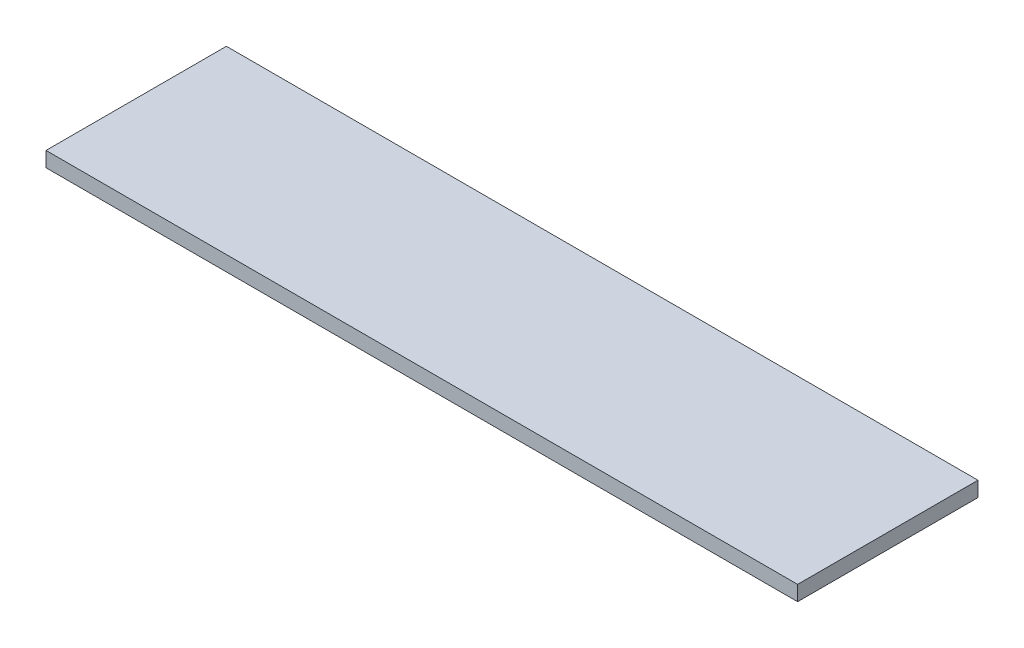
from build123d import *

# Parameters (mm, degrees)
BOSS_EXTRUDE1_DEPTH = 609.6
CUT_EXTRUDE1_REACH  = 2566.771
SKETCH2_W           = 76.2
SKETCH2_H           = 50.8


with BuildPart() as part:
    # Sketch1 → Boss-Extrude1 (new body)
    with BuildSketch(Plane.XY):
        Polygon((2438.4, 50.8), (2489.2, 50.8), (2489.2, 101.6), (-50.8, 101.6), (-50.8, 50.8), (0, 50.8), (0, 0), (2438.4, 0), align=None)
    extrude(amount=BOSS_EXTRUDE1_DEPTH)

    # Sketch2 → Cut-Extrude1 (cut, up to next)
    with BuildSketch(Plane(origin=(2438.4, 0, 0), x_dir=(0, 0, -1), z_dir=(1, 0, 0)), mode=Mode.PRIVATE) as cut_extrude1_sk1:
        with Locations((-571.5, 25.4)):
            Rectangle(SKETCH2_W, SKETCH2_H)
    cut_extrude1_tool1 = extrude(cut_extrude1_sk1.sketch, amount=-CUT_EXTRUDE1_REACH, mode=Mode.PRIVATE) & part.part
    add(cut_extrude1_tool1.solids().sort_by_distance((2438.4, 25.4, 571.5))[0], mode=Mode.SUBTRACT)


solid = part.part
